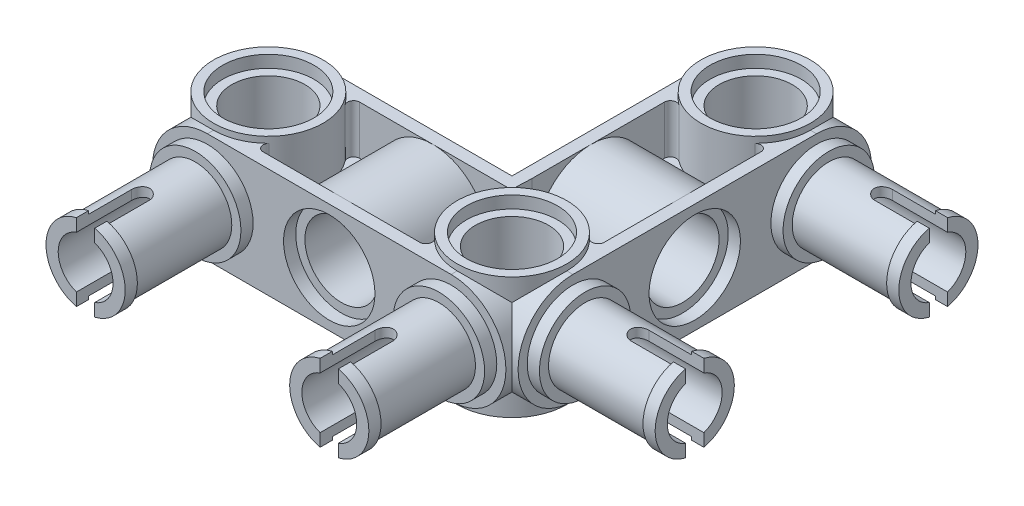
from build123d import *
from build123d.topology import SkipClean

# Parameters (mm, degrees)
BOSS_EXTRUDE1_DEPTH      = 3.6
BOSS_EXTRUDE1_DEPTH_BACK = 3.6
BOSS_EXTRUDE2_DEPTH      = 0.4
BOSS_EXTRUDE2_DEPTH_BACK = 3.6
BOSS_EXTRUDE3_DEPTH      = 0.4
BOSS_EXTRUDE3_DEPTH_BACK = 3.6
SKETCH7_R                = 3.6
BOSS_EXTRUDE4_DEPTH      = 0.4
SKETCH8_R                = 3
CUT_EXTRUDE3_DEPTH       = 0.8
SKETCH9_R                = 2.4
CUT_EXTRUDE4_DEPTH       = 29.638435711
SKETCH10_R               = 2.4
CUT_EXTRUDE5_DEPTH       = 31.93735606
SKETCH11_R               = 3
CUT_EXTRUDE6_DEPTH       = 0.8
SKETCH12_R               = 2.4
CUT_EXTRUDE7_DEPTH       = 31.93735606
SKETCH13_R               = 3
CUT_EXTRUDE8_DEPTH       = 0.8
SKETCH14_R               = 3
BOSS_EXTRUDE5_DEPTH      = 0.8
SKETCH15_R               = 3
BOSS_EXTRUDE6_DEPTH      = 0.8
SKETCH16_R               = 2.4
BOSS_EXTRUDE7_DEPTH      = 8
SKETCH17_R               = 2.4
BOSS_EXTRUDE8_DEPTH      = 8
SKETCH18_R               = 2.6
BOSS_EXTRUDE9_DEPTH      = 0.8
SKETCH19_R               = 2.6
BOSS_EXTRUDE10_DEPTH     = 0.8
SKETCH20_R               = 1.8
CUT_EXTRUDE9_DEPTH       = 8
SKETCH21_R               = 1.8
CUT_EXTRUDE10_DEPTH      = 8
CUT_EXTRUDE13_DEPTH      = 3.2
CUT_EXTRUDE13_DEPTH_BACK = 2.8
CUT_EXTRUDE14_START      = -3.2
CUT_EXTRUDE14_DEPTH      = 3.2
CUT_EXTRUDE15_DEPTH      = 3.2
CUT_EXTRUDE15_DEPTH_BACK = 2.8
CUT_EXTRUDE16_START      = -3.2
CUT_EXTRUDE16_DEPTH      = 3.2
CUT_EXTRUDE17_DEPTH      = 29.005713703
CUT_EXTRUDE17_DEPTH_BACK = 29.005713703


with BuildPart() as part:
    # Sketch2 → Boss-Extrude1 (new, two sides: drawn at the far end of the back side and taken through both)
    with BuildSketch(Plane(origin=(0, 0, 0), x_dir=(1, 0, 0), z_dir=(0, 1, 0)).offset(-BOSS_EXTRUDE1_DEPTH_BACK)):
        with BuildLine():
            Line((-16, 3.6), (-3.6, 3.6))
            Line((-3.6, 3.6), (-3.6, 16))
            ThreePointArc((-3.6, 16), (0, 19.6), (3.6, 16))
            Line((3.6, 16), (3.6, 0))
            ThreePointArc((3.6, 0), (2.545584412, -2.545584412), (0, -3.6))
            Line((0, -3.6), (-16, -3.6))
            ThreePointArc((-16, -3.6), (-19.6, 0), (-16, 3.6))
        make_face()
    extrude(amount=BOSS_EXTRUDE1_DEPTH + BOSS_EXTRUDE1_DEPTH_BACK)

    # Sketch5 → Boss-Extrude2 (add, two sides: drawn at the far end of the back side and taken through both)
    with BuildSketch(Plane(origin=(3.6, 0, 0), x_dir=(0, 0, -1), z_dir=(1, 0, 0)).offset(-BOSS_EXTRUDE2_DEPTH_BACK)):
        with BuildLine():
            Line((0, 3.6), (16, 3.6))
            ThreePointArc((16, 3.6), (19.6, 0), (16, -3.6))
            Line((16, -3.6), (0, -3.6))
            ThreePointArc((0, -3.6), (-3.6, 0), (0, 3.6))
        make_face()
    extrude(amount=BOSS_EXTRUDE2_DEPTH + BOSS_EXTRUDE2_DEPTH_BACK)

    # Sketch6 → Boss-Extrude3 (add, two sides: drawn at the far end of the back side and taken through both)
    with BuildSketch(Plane.XY.offset(3.6).offset(-BOSS_EXTRUDE3_DEPTH_BACK)):
        with BuildLine():
            Line((-16, 3.6), (0, 3.6))
            ThreePointArc((0, 3.6), (3.6, 0), (0, -3.6))
            Line((0, -3.6), (-16, -3.6))
            ThreePointArc((-16, -3.6), (-19.6, 0), (-16, 3.6))
        make_face()
    extrude(amount=BOSS_EXTRUDE3_DEPTH + BOSS_EXTRUDE3_DEPTH_BACK)

    # Sketch7 → Boss-Extrude4 (add)
    with SkipClean():  # the faces are left unmerged after this step: merging them gives an invalid solid
        with BuildSketch(Plane(origin=(0, 3.6, 0), x_dir=(1, 0, 0), z_dir=(0, 1, 0))):
            with Locations(Location((-16, 0, 0), (0, 0, 270))):
                Circle(SKETCH7_R)
            with Locations(Location((0, 0, 0), (0, 0, 270))):
                Circle(SKETCH7_R)
            with Locations(Location((0, 16, 0), (0, 0, 270))):
                Circle(SKETCH7_R)
        boss_extrude4 = extrude(amount=BOSS_EXTRUDE4_DEPTH)

    # Sketch8 → Cut-Extrude3 (cut)
    with SkipClean():  # the faces are left unmerged after this step: merging them gives an invalid solid
        with BuildSketch(Plane(origin=(0, 4, 0), x_dir=(1, 0, 0), z_dir=(0, 1, 0))):
            with Locations(Location((-16, 0, 0), (0, 0, 270))):
                Circle(SKETCH8_R)
            with Locations(Location((0, 0, 0), (0, 0, 270))):
                Circle(SKETCH8_R)
            with Locations(Location((0, 16, 0), (0, 0, 270))):
                Circle(SKETCH8_R)
        cut_extrude3 = extrude(amount=-CUT_EXTRUDE3_DEPTH, mode=Mode.SUBTRACT)

    # Mirror2: Boss-Extrude4, Cut-Extrude3 across plane
    with SkipClean():  # the faces are left unmerged after this step: merging them gives an invalid solid
        add(boss_extrude4.mirror(Plane.ZX))
        add(cut_extrude3.mirror(Plane.ZX), mode=Mode.SUBTRACT)

    # Sketch9 → Cut-Extrude4 (cut, through all)
    with SkipClean():  # the faces are left unmerged after this step: merging them gives an invalid solid
        with BuildSketch(Plane(origin=(0, 3.2, 0), x_dir=(1, 0, 0), z_dir=(0, 1, 0))):
            with Locations(Location((-16, 0, 0), (0, 0, 270))):
                Circle(SKETCH9_R)
            with Locations(Location((0, 0, 0), (0, 0, 270))):
                Circle(SKETCH9_R)
            with Locations(Location((0, 16, 0), (0, 0, 270))):
                Circle(SKETCH9_R)
        extrude(amount=-CUT_EXTRUDE4_DEPTH, mode=Mode.SUBTRACT)

    # Sketch10 → Cut-Extrude5 (cut, through all)
    with SkipClean():  # the faces are left unmerged after this step: merging them gives an invalid solid
        with BuildSketch(Plane.XY.offset(4)):
            with Locations((-8, 0)):
                Circle(SKETCH10_R)
        extrude(amount=-CUT_EXTRUDE5_DEPTH, mode=Mode.SUBTRACT)

    # Sketch11 → Cut-Extrude6 (cut)
    with SkipClean():  # the faces are left unmerged after this step: merging them gives an invalid solid
        with BuildSketch(Plane.XY.offset(4)):
            with Locations((-8, 0)):
                Circle(SKETCH11_R)
        extrude(amount=-CUT_EXTRUDE6_DEPTH, mode=Mode.SUBTRACT)

    # Sketch12 → Cut-Extrude7 (cut, through all)
    with SkipClean():  # the faces are left unmerged after this step: merging them gives an invalid solid
        with BuildSketch(Plane(origin=(4, 0, 0), x_dir=(0, 0, -1), z_dir=(1, 0, 0))):
            with Locations((8, 0)):
                Circle(SKETCH12_R)
        extrude(amount=-CUT_EXTRUDE7_DEPTH, mode=Mode.SUBTRACT)

    # Sketch13 → Cut-Extrude8 (cut)
    with SkipClean():  # the faces are left unmerged after this step: merging them gives an invalid solid
        with BuildSketch(Plane(origin=(4, 0, 0), x_dir=(0, 0, -1), z_dir=(1, 0, 0))):
            with Locations((8, 0)):
                Circle(SKETCH13_R)
        extrude(amount=-CUT_EXTRUDE8_DEPTH, mode=Mode.SUBTRACT)

    # Sketch14 → Boss-Extrude5 (add)
    with SkipClean():  # the faces are left unmerged after this step: merging them gives an invalid solid
        with BuildSketch(Plane(origin=(4, 0, 0), x_dir=(0, 0, -1), z_dir=(1, 0, 0))):
            Circle(SKETCH14_R)
            with Locations((16, 0)):
                Circle(SKETCH14_R)
        extrude(amount=BOSS_EXTRUDE5_DEPTH)

    # Sketch15 → Boss-Extrude6 (add)
    with SkipClean():  # the faces are left unmerged after this step: merging them gives an invalid solid
        with BuildSketch(Plane.XY.offset(4)):
            with Locations((-16, 0)):
                Circle(SKETCH15_R)
            Circle(SKETCH15_R)
        extrude(amount=BOSS_EXTRUDE6_DEPTH)

    # Sketch16 → Boss-Extrude7 (add)
    with SkipClean():  # the faces are left unmerged after this step: merging them gives an invalid solid
        with BuildSketch(Plane.XY.offset(4)):
            with Locations((-16, 0)):
                Circle(SKETCH16_R)
            Circle(SKETCH16_R)
        extrude(amount=BOSS_EXTRUDE7_DEPTH)

    # Sketch17 → Boss-Extrude8 (add)
    with SkipClean():  # the faces are left unmerged after this step: merging them gives an invalid solid
        with BuildSketch(Plane(origin=(4, 0, 0), x_dir=(0, 0, -1), z_dir=(1, 0, 0))):
            Circle(SKETCH17_R)
            with Locations((16, 0)):
                Circle(SKETCH17_R)
        extrude(amount=BOSS_EXTRUDE8_DEPTH)

    # Sketch18 → Boss-Extrude9 (add)
    with SkipClean():  # the faces are left unmerged after this step: merging them gives an invalid solid
        with BuildSketch(Plane.XY.offset(12)):
            with Locations((-16, 0)):
                Circle(SKETCH18_R)
            Circle(SKETCH18_R)
        extrude(amount=-BOSS_EXTRUDE9_DEPTH)

    # Sketch19 → Boss-Extrude10 (add)
    with SkipClean():  # the faces are left unmerged after this step: merging them gives an invalid solid
        with BuildSketch(Plane(origin=(12, 0, 0), x_dir=(0, 0, -1), z_dir=(1, 0, 0))):
            Circle(SKETCH19_R)
            with Locations((16, 0)):
                Circle(SKETCH19_R)
        extrude(amount=-BOSS_EXTRUDE10_DEPTH)

    # Sketch20 → Cut-Extrude9 (cut)
    with SkipClean():  # the faces are left unmerged after this step: merging them gives an invalid solid
        with BuildSketch(Plane(origin=(12, 0, 0), x_dir=(0, 0, -1), z_dir=(1, 0, 0))):
            Circle(SKETCH20_R)
            with Locations((16, 0)):
                Circle(SKETCH20_R)
        extrude(amount=-CUT_EXTRUDE9_DEPTH, mode=Mode.SUBTRACT)

    # Sketch21 → Cut-Extrude10 (cut)
    with SkipClean():  # the faces are left unmerged after this step: merging them gives an invalid solid
        with BuildSketch(Plane.XY.offset(12)):
            with Locations((-16, 0)):
                Circle(SKETCH21_R)
            Circle(SKETCH21_R)
        extrude(amount=-CUT_EXTRUDE10_DEPTH, mode=Mode.SUBTRACT)

    # Sketch24 → Cut-Extrude13 (cut, two sides: drawn at the far end of the back side and taken through both)
    with SkipClean():  # the faces are left unmerged after this step: merging them gives an invalid solid
        with BuildSketch(Plane.XY.offset(-CUT_EXTRUDE13_DEPTH_BACK)):
            with BuildLine():
                Line((-11.959810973, 3.6), (-11.959810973, 0.4))
                Line((-11.959810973, 0.4), (-11.577708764, 0.4))
                ThreePointArc((-11.577708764, 0.4), (-8, 3.6), (-4.422291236, 0.4))
                Line((-4.422291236, 0.4), (-4.041007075, 0.4))
                Line((-4.041007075, 0.4), (-4.041007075, 3.6))
                Line((-4.041007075, 3.6), (-4.041007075, 4.433611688))
                Line((-4.041007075, 4.433611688), (-11.959810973, 4.433611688))
                Line((-11.959810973, 4.433611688), (-11.959810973, 3.6))
            make_face()
            with BuildLine():
                Line((-4.041007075, -3.6), (-4.041007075, -0.4))
                Line((-4.041007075, -0.4), (-4.422291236, -0.4))
                ThreePointArc((-4.422291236, -0.4), (-8, -3.6), (-11.577708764, -0.4))
                Line((-11.577708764, -0.4), (-11.959810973, -0.4))
                Line((-11.959810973, -0.4), (-11.959810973, -3.6))
                Line((-11.959810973, -3.6), (-11.959810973, -4.413403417))
                Line((-11.959810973, -4.413403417), (-4.041007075, -4.413403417))
                Line((-4.041007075, -4.413403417), (-4.041007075, -3.6))
            make_face()
        extrude(amount=CUT_EXTRUDE13_DEPTH + CUT_EXTRUDE13_DEPTH_BACK, mode=Mode.SUBTRACT)

    # Sketch25 → Cut-Extrude14 (cut)
    with SkipClean():  # the faces are left unmerged after this step: merging them gives an invalid solid
        with BuildSketch(Plane(origin=(0, 3.6, 0), x_dir=(1, 0, 0), z_dir=(0, 1, 0)).offset(CUT_EXTRUDE14_START)):
            with BuildLine():
                Line((-11.959810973, 2.8), (-12.8, 2.8))
                ThreePointArc((-12.8, 2.8), (-13.157770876, 2.578885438), (-13.12, 2.16))
                ThreePointArc((-13.12, 2.16), (-12.407825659, -0.237241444), (-13.429085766, -2.52))
                ThreePointArc((-13.429085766, -2.52), (-13.512210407, -2.954919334), (-13.143428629, -3.2))
                Line((-13.143428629, -3.2), (-11.959810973, -3.2))
                Line((-11.959810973, -3.2), (-11.959810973, 2.8))
            make_face()
            with BuildLine():
                Line((-4.041007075, 2.8), (-3.2, 2.8))
                ThreePointArc((-3.2, 2.8), (-2.842229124, 2.578885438), (-2.88, 2.16))
                ThreePointArc((-2.88, 2.16), (-3.592174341, -0.237241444), (-2.570914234, -2.52))
                ThreePointArc((-2.570914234, -2.52), (-2.487789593, -2.954919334), (-2.856571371, -3.2))
                Line((-2.856571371, -3.2), (-4.041007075, -3.2))
                Line((-4.041007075, -3.2), (-4.041007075, 2.8))
            make_face()
        cut_extrude14 = extrude(amount=CUT_EXTRUDE14_DEPTH, mode=Mode.SUBTRACT)

    # Mirror3: Cut-Extrude14 across plane
    with SkipClean():  # the faces are left unmerged after this step: merging them gives an invalid solid
        add(cut_extrude14.mirror(Plane.ZX), mode=Mode.SUBTRACT)

    # Sketch26 → Cut-Extrude15 (cut, two sides: drawn at the far end of the back side and taken through both)
    with SkipClean():  # the faces are left unmerged after this step: merging them gives an invalid solid
        with BuildSketch(Plane(origin=(0, 0, 0), x_dir=(0, 0, -1), z_dir=(1, 0, 0)).offset(-CUT_EXTRUDE15_DEPTH_BACK)):
            with BuildLine():
                Line((4.109866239, 5.108733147), (4.109866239, 0.4))
                Line((4.109866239, 0.4), (4.422291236, 0.4))
                ThreePointArc((4.422291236, 0.4), (8, 3.6), (11.577708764, 0.4))
                Line((11.577708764, 0.4), (11.822092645, 0.4))
                Line((11.822092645, 0.4), (11.822092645, 5.108733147))
                Line((11.822092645, 5.108733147), (4.109866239, 5.108733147))
            make_face()
            with BuildLine():
                Line((4.109866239, -4.734067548), (11.822092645, -4.734067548))
                Line((11.822092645, -4.734067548), (11.822092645, -0.4))
                Line((11.822092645, -0.4), (11.577708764, -0.4))
                ThreePointArc((11.577708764, -0.4), (8, -3.6), (4.422291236, -0.4))
                Line((4.422291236, -0.4), (4.109866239, -0.4))
                Line((4.109866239, -0.4), (4.109866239, -4.734067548))
            make_face()
        extrude(amount=CUT_EXTRUDE15_DEPTH + CUT_EXTRUDE15_DEPTH_BACK, mode=Mode.SUBTRACT)

    # Sketch27 → Cut-Extrude16 (cut)
    with SkipClean():  # the faces are left unmerged after this step: merging them gives an invalid solid
        with BuildSketch(Plane(origin=(0, 3.6, 0), x_dir=(1, 0, 0), z_dir=(0, 1, 0)).offset(CUT_EXTRUDE16_START)):
            with BuildLine():
                Line((-2.8, 11.822092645), (-2.8, 12.8))
                ThreePointArc((-2.8, 12.8), (-2.578885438, 13.157770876), (-2.16, 13.12))
                ThreePointArc((-2.16, 13.12), (0.237241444, 12.407825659), (2.52, 13.429085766))
                ThreePointArc((2.52, 13.429085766), (2.954919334, 13.512210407), (3.2, 13.143428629))
                Line((3.2, 13.143428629), (3.2, 11.822092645))
                Line((3.2, 11.822092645), (-2.8, 11.822092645))
            make_face()
            with BuildLine():
                Line((3.2, 4.109866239), (3.2, 2.856571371))
                ThreePointArc((3.2, 2.856571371), (2.954919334, 2.487789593), (2.52, 2.570914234))
                ThreePointArc((2.52, 2.570914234), (0.215708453, 3.59353167), (-2.19436522, 2.853902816))
                ThreePointArc((-2.19436522, 2.853902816), (-2.622241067, 2.815865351), (-2.837847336, 3.187400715))
                Line((-2.837847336, 3.187400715), (-2.8, 4.109866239))
                Line((-2.8, 4.109866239), (3.2, 4.109866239))
            make_face()
        cut_extrude16 = extrude(amount=CUT_EXTRUDE16_DEPTH, mode=Mode.SUBTRACT)

    # Mirror4: Cut-Extrude16 across plane
    with SkipClean():  # the faces are left unmerged after this step: merging them gives an invalid solid
        add(cut_extrude16.mirror(Plane.ZX), mode=Mode.SUBTRACT)

    # Sketch28 → Cut-Extrude17 (cut, two sides: drawn at the far end of the back side and taken through both)
    with SkipClean():  # the faces are left unmerged after this step: merging them gives an invalid solid
        with BuildSketch(Plane(origin=(0, 0, 0), x_dir=(1, 0, 0), z_dir=(0, 1, 0)).offset(-CUT_EXTRUDE17_DEPTH_BACK)):
            with BuildLine():
                Line((-0.6, -12), (-0.6, -8.4))
                ThreePointArc((-0.6, -8.4), (0, -7.8), (0.6, -8.4))
                Line((0.6, -8.4), (0.6, -12))
                Line((0.6, -12), (-0.6, -12))
            make_face()
            with BuildLine():
                Line((-16.6, -12), (-16.6, -8.4))
                ThreePointArc((-16.6, -8.4), (-16, -7.8), (-15.4, -8.4))
                Line((-15.4, -8.4), (-15.4, -12))
                Line((-15.4, -12), (-16.6, -12))
            make_face()
            with BuildLine():
                Line((12, -0.6), (8.4, -0.6))
                ThreePointArc((8.4, -0.6), (7.8, 0), (8.4, 0.6))
                Line((8.4, 0.6), (12, 0.6))
                Line((12, 0.6), (12, -0.6))
            make_face()
            with BuildLine():
                Line((12, 15.4), (8.4, 15.4))
                ThreePointArc((8.4, 15.4), (7.8, 16), (8.4, 16.6))
                Line((8.4, 16.6), (12, 16.6))
                Line((12, 16.6), (12, 15.4))
            make_face()
        extrude(amount=CUT_EXTRUDE17_DEPTH + CUT_EXTRUDE17_DEPTH_BACK, mode=Mode.SUBTRACT)


solid = part.part
